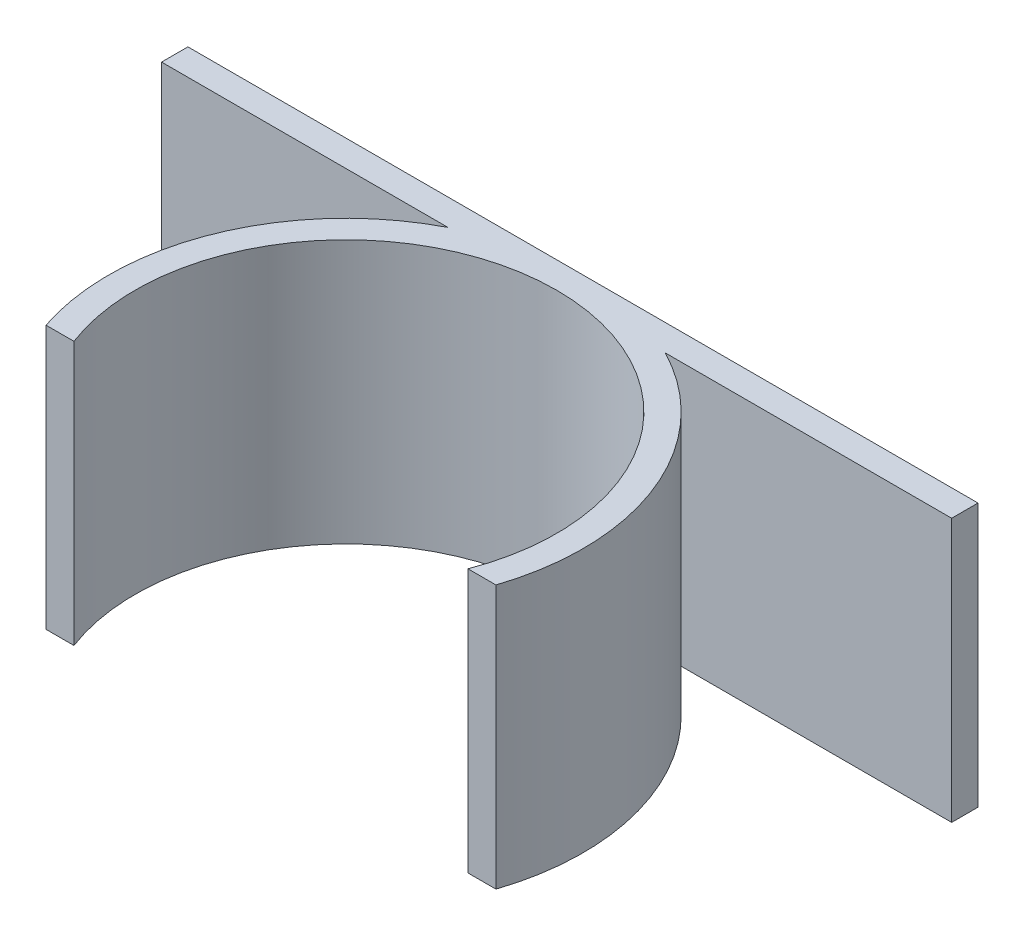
ISO-10303-21;
HEADER;
FILE_DESCRIPTION(('STEP AP214'),'2;1');
FILE_NAME('part.step','',(''),(''),'','','');
FILE_SCHEMA(('AUTOMOTIVE_DESIGN { 1 0 10303 214 1 1 1 1 }'));
ENDSEC;
DATA;
#1=APPLICATION_CONTEXT('core data for automotive mechanical design processes');
#2=APPLICATION_PROTOCOL_DEFINITION('international standard','automotive_design',2000,#1);
#3=PRODUCT_CONTEXT('',#1,'mechanical');
#4=PRODUCT('Part','Part','',(#3));
#5=PRODUCT_RELATED_PRODUCT_CATEGORY('part','',(#4));
#6=PRODUCT_DEFINITION_FORMATION('','',#4);
#7=PRODUCT_DEFINITION_CONTEXT('part definition',#1,'design');
#8=PRODUCT_DEFINITION('design','',#6,#7);
#9=PRODUCT_DEFINITION_SHAPE('','',#8);
#10=(LENGTH_UNIT() NAMED_UNIT(*) SI_UNIT(.MILLI.,.METRE.));
#11=(NAMED_UNIT(*) PLANE_ANGLE_UNIT() SI_UNIT($,.RADIAN.));
#12=(NAMED_UNIT(*) SI_UNIT($,.STERADIAN.) SOLID_ANGLE_UNIT());
#13=UNCERTAINTY_MEASURE_WITH_UNIT(LENGTH_MEASURE(1.E-05),#10,'distance_accuracy_value','');
#14=(GEOMETRIC_REPRESENTATION_CONTEXT(3) GLOBAL_UNCERTAINTY_ASSIGNED_CONTEXT((#13)) GLOBAL_UNIT_ASSIGNED_CONTEXT((#10,
#11,#12)) REPRESENTATION_CONTEXT('',''));
#15=CARTESIAN_POINT('',(0.,0.,0.));
#16=DIRECTION('',(0.,0.,1.));
#17=DIRECTION('',(1.,0.,0.));
#18=AXIS2_PLACEMENT_3D('',#15,#16,#17);
#19=CARTESIAN_POINT('',(0.,10.,0.));
#20=DIRECTION('',(0.,-1.,0.));
#21=DIRECTION('',(0.,0.,-1.));
#22=AXIS2_PLACEMENT_3D('',#19,#20,#21);
#23=CYLINDRICAL_SURFACE('',#22,9.);
#24=CARTESIAN_POINT('',(0.,0.,0.));
#25=DIRECTION('',(0.,1.,0.));
#26=DIRECTION('',(0.,0.,1.));
#27=AXIS2_PLACEMENT_3D('',#24,#25,#26);
#28=CIRCLE('',#27,9.);
#29=CARTESIAN_POINT('',(-4.12310562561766,0.,-8.));
#30=VERTEX_POINT('',#29);
#31=CARTESIAN_POINT('',(-8.53945417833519,0.,2.84213341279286));
#32=VERTEX_POINT('',#31);
#33=EDGE_CURVE('E155',#30,#32,#28,.T.);
#34=ORIENTED_EDGE('',*,*,#33,.T.);
#35=DIRECTION('',(0.,-1.,0.));
#36=VECTOR('',#35,1.);
#37=CARTESIAN_POINT('',(-8.53945417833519,10.,2.84213341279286));
#38=LINE('',#37,#36);
#39=CARTESIAN_POINT('',(-8.53945417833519,10.,2.84213341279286));
#40=VERTEX_POINT('',#39);
#41=EDGE_CURVE('E139',#32,#40,#38,.F.);
#42=ORIENTED_EDGE('',*,*,#41,.T.);
#43=CARTESIAN_POINT('',(0.,10.,0.));
#44=DIRECTION('',(0.,1.,0.));
#45=DIRECTION('',(0.,0.,1.));
#46=AXIS2_PLACEMENT_3D('',#43,#44,#45);
#47=CIRCLE('',#46,9.);
#48=CARTESIAN_POINT('',(-4.12310562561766,10.,-8.));
#49=VERTEX_POINT('',#48);
#50=EDGE_CURVE('E167',#49,#40,#47,.T.);
#51=ORIENTED_EDGE('',*,*,#50,.F.);
#52=DIRECTION('',(0.,-1.,0.));
#53=VECTOR('',#52,1.);
#54=CARTESIAN_POINT('',(-4.12310562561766,10.,-8.));
#55=LINE('',#54,#53);
#56=EDGE_CURVE('E163',#49,#30,#55,.T.);
#57=ORIENTED_EDGE('',*,*,#56,.T.);
#58=EDGE_LOOP('',(#34,#42,#51,#57));
#59=FACE_BOUND('',#58,.T.);
#60=ADVANCED_FACE('F65',(#59),#23,.T.);
#61=CARTESIAN_POINT('',(8.53945417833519,10.,2.84213341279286));
#62=VERTEX_POINT('',#61);
#63=CARTESIAN_POINT('',(4.12310562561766,10.,-8.));
#64=VERTEX_POINT('',#63);
#65=EDGE_CURVE('E164',#62,#64,#47,.T.);
#66=ORIENTED_EDGE('',*,*,#65,.F.);
#67=DIRECTION('',(0.,-1.,0.));
#68=VECTOR('',#67,1.);
#69=CARTESIAN_POINT('',(8.53945417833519,10.,2.84213341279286));
#70=LINE('',#69,#68);
#71=CARTESIAN_POINT('',(8.53945417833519,0.,2.84213341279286));
#72=VERTEX_POINT('',#71);
#73=EDGE_CURVE('E147',#62,#72,#70,.T.);
#74=ORIENTED_EDGE('',*,*,#73,.T.);
#75=CARTESIAN_POINT('',(4.12310562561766,0.,-8.));
#76=VERTEX_POINT('',#75);
#77=EDGE_CURVE('E165',#72,#76,#28,.T.);
#78=ORIENTED_EDGE('',*,*,#77,.T.);
#79=DIRECTION('',(0.,-1.,0.));
#80=VECTOR('',#79,1.);
#81=CARTESIAN_POINT('',(4.12310562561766,10.,-8.));
#82=LINE('',#81,#80);
#83=EDGE_CURVE('E213',#64,#76,#82,.T.);
#84=ORIENTED_EDGE('',*,*,#83,.F.);
#85=EDGE_LOOP('',(#66,#74,#78,#84));
#86=FACE_BOUND('',#85,.T.);
#87=ADVANCED_FACE('F67',(#86),#23,.T.);
#88=CARTESIAN_POINT('',(0.,10.,0.));
#89=DIRECTION('',(0.,1.,0.));
#90=DIRECTION('',(0.,0.,1.));
#91=AXIS2_PLACEMENT_3D('',#88,#89,#90);
#92=PLANE('',#91);
#93=DIRECTION('',(1.,0.,0.));
#94=VECTOR('',#93,1.);
#95=CARTESIAN_POINT('',(-8.78160973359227,10.,2.84213341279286));
#96=LINE('',#95,#94);
#97=CARTESIAN_POINT('',(7.47811992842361,10.,2.84213341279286));
#98=VERTEX_POINT('',#97);
#99=EDGE_CURVE('E87',#98,#62,#96,.T.);
#100=ORIENTED_EDGE('',*,*,#99,.T.);
#101=ORIENTED_EDGE('',*,*,#65,.T.);
#102=DIRECTION('',(1.,0.,0.));
#103=VECTOR('',#102,1.);
#104=CARTESIAN_POINT('',(0.,10.,-8.));
#105=LINE('',#104,#103);
#106=CARTESIAN_POINT('',(14.9949090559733,10.,-8.));
#107=VERTEX_POINT('',#106);
#108=EDGE_CURVE('E203',#64,#107,#105,.T.);
#109=ORIENTED_EDGE('',*,*,#108,.T.);
#110=DIRECTION('',(0.,0.,1.));
#111=VECTOR('',#110,1.);
#112=CARTESIAN_POINT('',(14.9949090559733,10.,0.));
#113=LINE('',#112,#111);
#114=CARTESIAN_POINT('',(14.9949090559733,10.,-9.));
#115=VERTEX_POINT('',#114);
#116=EDGE_CURVE('E199',#115,#107,#113,.T.);
#117=ORIENTED_EDGE('',*,*,#116,.F.);
#118=DIRECTION('',(1.,0.,0.));
#119=VECTOR('',#118,1.);
#120=CARTESIAN_POINT('',(0.,10.,-9.));
#121=LINE('',#120,#119);
#122=CARTESIAN_POINT('',(-14.9949090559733,10.,-9.));
#123=VERTEX_POINT('',#122);
#124=EDGE_CURVE('E196',#123,#115,#121,.T.);
#125=ORIENTED_EDGE('',*,*,#124,.F.);
#126=DIRECTION('',(0.,0.,1.));
#127=VECTOR('',#126,1.);
#128=CARTESIAN_POINT('',(-14.9949090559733,10.,0.));
#129=LINE('',#128,#127);
#130=CARTESIAN_POINT('',(-14.9949090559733,10.,-8.));
#131=VERTEX_POINT('',#130);
#132=EDGE_CURVE('E179',#123,#131,#129,.T.);
#133=ORIENTED_EDGE('',*,*,#132,.T.);
#134=DIRECTION('',(1.,0.,0.));
#135=VECTOR('',#134,1.);
#136=CARTESIAN_POINT('',(0.,10.,-8.));
#137=LINE('',#136,#135);
#138=EDGE_CURVE('E177',#131,#49,#137,.T.);
#139=ORIENTED_EDGE('',*,*,#138,.T.);
#140=ORIENTED_EDGE('',*,*,#50,.T.);
#141=CARTESIAN_POINT('',(-7.47811992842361,10.,2.84213341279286));
#142=VERTEX_POINT('',#141);
#143=EDGE_CURVE('E142',#40,#142,#96,.T.);
#144=ORIENTED_EDGE('',*,*,#143,.T.);
#145=CARTESIAN_POINT('',(0.,10.,0.));
#146=DIRECTION('',(0.,1.,0.));
#147=DIRECTION('',(0.,0.,1.));
#148=AXIS2_PLACEMENT_3D('',#145,#146,#147);
#149=CIRCLE('',#148,8.);
#150=EDGE_CURVE('E169',#98,#142,#149,.T.);
#151=ORIENTED_EDGE('',*,*,#150,.F.);
#152=EDGE_LOOP('',(#100,#101,#109,#117,#125,#133,#139,#140,#144,#151));
#153=FACE_BOUND('',#152,.T.);
#154=ADVANCED_FACE('F173',(#153),#92,.T.);
#155=CARTESIAN_POINT('',(0.,0.,0.));
#156=DIRECTION('',(0.,1.,0.));
#157=DIRECTION('',(0.,0.,1.));
#158=AXIS2_PLACEMENT_3D('',#155,#156,#157);
#159=PLANE('',#158);
#160=ORIENTED_EDGE('',*,*,#77,.F.);
#161=DIRECTION('',(1.,0.,0.));
#162=VECTOR('',#161,1.);
#163=CARTESIAN_POINT('',(-8.78160973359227,0.,2.84213341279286));
#164=LINE('',#163,#162);
#165=CARTESIAN_POINT('',(7.47811992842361,0.,2.84213341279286));
#166=VERTEX_POINT('',#165);
#167=EDGE_CURVE('E160',#166,#72,#164,.T.);
#168=ORIENTED_EDGE('',*,*,#167,.F.);
#169=CARTESIAN_POINT('',(0.,0.,0.));
#170=DIRECTION('',(0.,1.,0.));
#171=DIRECTION('',(0.,0.,1.));
#172=AXIS2_PLACEMENT_3D('',#169,#170,#171);
#173=CIRCLE('',#172,8.);
#174=CARTESIAN_POINT('',(-7.47811992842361,0.,2.84213341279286));
#175=VERTEX_POINT('',#174);
#176=EDGE_CURVE('E159',#166,#175,#173,.T.);
#177=ORIENTED_EDGE('',*,*,#176,.T.);
#178=EDGE_CURVE('E80',#32,#175,#164,.T.);
#179=ORIENTED_EDGE('',*,*,#178,.F.);
#180=ORIENTED_EDGE('',*,*,#33,.F.);
#181=DIRECTION('',(1.,0.,0.));
#182=VECTOR('',#181,1.);
#183=CARTESIAN_POINT('',(0.,0.,-8.));
#184=LINE('',#183,#182);
#185=CARTESIAN_POINT('',(-14.9949090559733,0.,-8.));
#186=VERTEX_POINT('',#185);
#187=EDGE_CURVE('E146',#186,#30,#184,.T.);
#188=ORIENTED_EDGE('',*,*,#187,.F.);
#189=DIRECTION('',(0.,0.,1.));
#190=VECTOR('',#189,1.);
#191=CARTESIAN_POINT('',(-14.9949090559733,0.,0.));
#192=LINE('',#191,#190);
#193=CARTESIAN_POINT('',(-14.9949090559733,0.,-9.));
#194=VERTEX_POINT('',#193);
#195=EDGE_CURVE('E186',#194,#186,#192,.T.);
#196=ORIENTED_EDGE('',*,*,#195,.F.);
#197=DIRECTION('',(1.,0.,0.));
#198=VECTOR('',#197,1.);
#199=CARTESIAN_POINT('',(0.,0.,-9.));
#200=LINE('',#199,#198);
#201=CARTESIAN_POINT('',(14.9949090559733,0.,-9.));
#202=VERTEX_POINT('',#201);
#203=EDGE_CURVE('E194',#194,#202,#200,.T.);
#204=ORIENTED_EDGE('',*,*,#203,.T.);
#205=DIRECTION('',(0.,0.,1.));
#206=VECTOR('',#205,1.);
#207=CARTESIAN_POINT('',(14.9949090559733,0.,0.));
#208=LINE('',#207,#206);
#209=CARTESIAN_POINT('',(14.9949090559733,0.,-8.));
#210=VERTEX_POINT('',#209);
#211=EDGE_CURVE('E208',#202,#210,#208,.T.);
#212=ORIENTED_EDGE('',*,*,#211,.T.);
#213=DIRECTION('',(1.,0.,0.));
#214=VECTOR('',#213,1.);
#215=CARTESIAN_POINT('',(0.,0.,-8.));
#216=LINE('',#215,#214);
#217=EDGE_CURVE('E200',#76,#210,#216,.T.);
#218=ORIENTED_EDGE('',*,*,#217,.F.);
#219=EDGE_LOOP('',(#160,#168,#177,#179,#180,#188,#196,#204,#212,#218));
#220=FACE_BOUND('',#219,.T.);
#221=ADVANCED_FACE('F153',(#220),#159,.F.);
#222=CARTESIAN_POINT('',(0.,10.,0.));
#223=DIRECTION('',(0.,-1.,0.));
#224=DIRECTION('',(0.,0.,-1.));
#225=AXIS2_PLACEMENT_3D('',#222,#223,#224);
#226=CYLINDRICAL_SURFACE('',#225,8.);
#227=DIRECTION('',(0.,-1.,0.));
#228=VECTOR('',#227,1.);
#229=CARTESIAN_POINT('',(7.47811992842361,10.,2.84213341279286));
#230=LINE('',#229,#228);
#231=EDGE_CURVE('E12',#98,#166,#230,.T.);
#232=ORIENTED_EDGE('',*,*,#231,.F.);
#233=ORIENTED_EDGE('',*,*,#150,.T.);
#234=DIRECTION('',(0.,-1.,0.));
#235=VECTOR('',#234,1.);
#236=CARTESIAN_POINT('',(-7.47811992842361,10.,2.84213341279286));
#237=LINE('',#236,#235);
#238=EDGE_CURVE('E73',#175,#142,#237,.F.);
#239=ORIENTED_EDGE('',*,*,#238,.F.);
#240=ORIENTED_EDGE('',*,*,#176,.F.);
#241=EDGE_LOOP('',(#232,#233,#239,#240));
#242=FACE_BOUND('',#241,.T.);
#243=ADVANCED_FACE('F220',(#242),#226,.F.);
#244=CARTESIAN_POINT('',(0.,10.,-9.));
#245=DIRECTION('',(0.,0.,-1.));
#246=DIRECTION('',(-1.,0.,0.));
#247=AXIS2_PLACEMENT_3D('',#244,#245,#246);
#248=PLANE('',#247);
#249=ORIENTED_EDGE('',*,*,#203,.F.);
#250=DIRECTION('',(0.,-1.,0.));
#251=VECTOR('',#250,1.);
#252=CARTESIAN_POINT('',(-14.9949090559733,10.,-9.));
#253=LINE('',#252,#251);
#254=EDGE_CURVE('E183',#123,#194,#253,.T.);
#255=ORIENTED_EDGE('',*,*,#254,.F.);
#256=ORIENTED_EDGE('',*,*,#124,.T.);
#257=DIRECTION('',(0.,-1.,0.));
#258=VECTOR('',#257,1.);
#259=CARTESIAN_POINT('',(14.9949090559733,10.,-9.));
#260=LINE('',#259,#258);
#261=EDGE_CURVE('E205',#115,#202,#260,.T.);
#262=ORIENTED_EDGE('',*,*,#261,.T.);
#263=EDGE_LOOP('',(#249,#255,#256,#262));
#264=FACE_BOUND('',#263,.T.);
#265=ADVANCED_FACE('F235',(#264),#248,.T.);
#266=CARTESIAN_POINT('',(0.,10.,-8.));
#267=DIRECTION('',(0.,0.,-1.));
#268=DIRECTION('',(-1.,0.,0.));
#269=AXIS2_PLACEMENT_3D('',#266,#267,#268);
#270=PLANE('',#269);
#271=ORIENTED_EDGE('',*,*,#217,.T.);
#272=DIRECTION('',(0.,-1.,0.));
#273=VECTOR('',#272,1.);
#274=CARTESIAN_POINT('',(14.9949090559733,10.,-8.));
#275=LINE('',#274,#273);
#276=EDGE_CURVE('E216',#107,#210,#275,.T.);
#277=ORIENTED_EDGE('',*,*,#276,.F.);
#278=ORIENTED_EDGE('',*,*,#108,.F.);
#279=ORIENTED_EDGE('',*,*,#83,.T.);
#280=EDGE_LOOP('',(#271,#277,#278,#279));
#281=FACE_BOUND('',#280,.T.);
#282=ADVANCED_FACE('F230',(#281),#270,.F.);
#283=CARTESIAN_POINT('',(14.9949090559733,10.,0.));
#284=DIRECTION('',(1.,0.,0.));
#285=DIRECTION('',(0.,0.,-1.));
#286=AXIS2_PLACEMENT_3D('',#283,#284,#285);
#287=PLANE('',#286);
#288=ORIENTED_EDGE('',*,*,#211,.F.);
#289=ORIENTED_EDGE('',*,*,#261,.F.);
#290=ORIENTED_EDGE('',*,*,#116,.T.);
#291=ORIENTED_EDGE('',*,*,#276,.T.);
#292=EDGE_LOOP('',(#288,#289,#290,#291));
#293=FACE_BOUND('',#292,.T.);
#294=ADVANCED_FACE('F241',(#293),#287,.T.);
#295=CARTESIAN_POINT('',(0.,10.,-8.));
#296=DIRECTION('',(0.,0.,-1.));
#297=DIRECTION('',(-1.,0.,0.));
#298=AXIS2_PLACEMENT_3D('',#295,#296,#297);
#299=PLANE('',#298);
#300=ORIENTED_EDGE('',*,*,#187,.T.);
#301=ORIENTED_EDGE('',*,*,#56,.F.);
#302=ORIENTED_EDGE('',*,*,#138,.F.);
#303=DIRECTION('',(0.,-1.,0.));
#304=VECTOR('',#303,1.);
#305=CARTESIAN_POINT('',(-14.9949090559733,10.,-8.));
#306=LINE('',#305,#304);
#307=EDGE_CURVE('E187',#131,#186,#306,.T.);
#308=ORIENTED_EDGE('',*,*,#307,.T.);
#309=EDGE_LOOP('',(#300,#301,#302,#308));
#310=FACE_BOUND('',#309,.T.);
#311=ADVANCED_FACE('F185',(#310),#299,.F.);
#312=CARTESIAN_POINT('',(-14.9949090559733,10.,0.));
#313=DIRECTION('',(1.,0.,0.));
#314=DIRECTION('',(0.,0.,-1.));
#315=AXIS2_PLACEMENT_3D('',#312,#313,#314);
#316=PLANE('',#315);
#317=ORIENTED_EDGE('',*,*,#195,.T.);
#318=ORIENTED_EDGE('',*,*,#307,.F.);
#319=ORIENTED_EDGE('',*,*,#132,.F.);
#320=ORIENTED_EDGE('',*,*,#254,.T.);
#321=EDGE_LOOP('',(#317,#318,#319,#320));
#322=FACE_BOUND('',#321,.T.);
#323=ADVANCED_FACE('F240',(#322),#316,.F.);
#324=CARTESIAN_POINT('',(-8.78160973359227,10.,2.84213341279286));
#325=DIRECTION('',(0.,0.,-1.));
#326=DIRECTION('',(-1.,0.,0.));
#327=AXIS2_PLACEMENT_3D('',#324,#325,#326);
#328=PLANE('',#327);
#329=ORIENTED_EDGE('',*,*,#178,.T.);
#330=ORIENTED_EDGE('',*,*,#238,.T.);
#331=ORIENTED_EDGE('',*,*,#143,.F.);
#332=ORIENTED_EDGE('',*,*,#41,.F.);
#333=EDGE_LOOP('',(#329,#330,#331,#332));
#334=FACE_BOUND('',#333,.T.);
#335=ADVANCED_FACE('F140',(#334),#328,.F.);
#336=ORIENTED_EDGE('',*,*,#99,.F.);
#337=ORIENTED_EDGE('',*,*,#231,.T.);
#338=ORIENTED_EDGE('',*,*,#167,.T.);
#339=ORIENTED_EDGE('',*,*,#73,.F.);
#340=EDGE_LOOP('',(#336,#337,#338,#339));
#341=FACE_BOUND('',#340,.T.);
#342=ADVANCED_FACE('F305',(#341),#328,.F.);
#343=CLOSED_SHELL('',(#60,#87,#154,#221,#243,#265,#282,#294,#311,#323,#335,#342));
#344=MANIFOLD_SOLID_BREP('B2',#343);
#345=ADVANCED_BREP_SHAPE_REPRESENTATION('',(#18,#344),#14);
#346=SHAPE_DEFINITION_REPRESENTATION(#9,#345);
ENDSEC;
END-ISO-10303-21;
